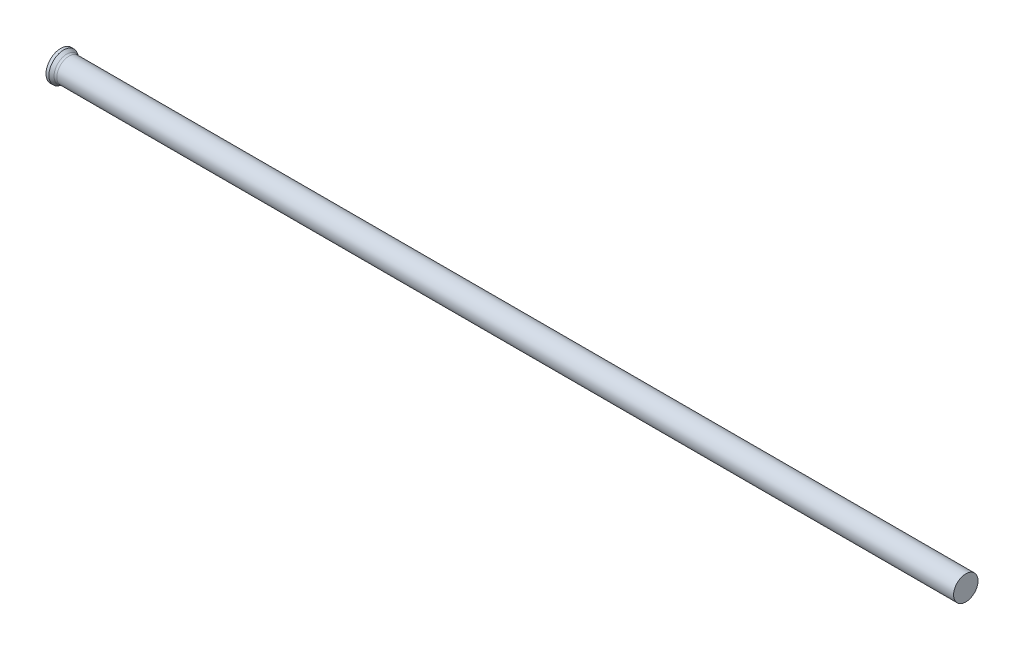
ISO-10303-21;
HEADER;
FILE_DESCRIPTION(('STEP AP214'),'2;1');
FILE_NAME('part.step','',(''),(''),'','','');
FILE_SCHEMA(('AUTOMOTIVE_DESIGN { 1 0 10303 214 1 1 1 1 }'));
ENDSEC;
DATA;
#1=APPLICATION_CONTEXT('core data for automotive mechanical design processes');
#2=APPLICATION_PROTOCOL_DEFINITION('international standard','automotive_design',2000,#1);
#3=PRODUCT_CONTEXT('',#1,'mechanical');
#4=PRODUCT('Part','Part','',(#3));
#5=PRODUCT_RELATED_PRODUCT_CATEGORY('part','',(#4));
#6=PRODUCT_DEFINITION_FORMATION('','',#4);
#7=PRODUCT_DEFINITION_CONTEXT('part definition',#1,'design');
#8=PRODUCT_DEFINITION('design','',#6,#7);
#9=PRODUCT_DEFINITION_SHAPE('','',#8);
#10=(LENGTH_UNIT() NAMED_UNIT(*) SI_UNIT(.MILLI.,.METRE.));
#11=(NAMED_UNIT(*) PLANE_ANGLE_UNIT() SI_UNIT($,.RADIAN.));
#12=(NAMED_UNIT(*) SI_UNIT($,.STERADIAN.) SOLID_ANGLE_UNIT());
#13=UNCERTAINTY_MEASURE_WITH_UNIT(LENGTH_MEASURE(1.E-05),#10,'distance_accuracy_value','');
#14=(GEOMETRIC_REPRESENTATION_CONTEXT(3) GLOBAL_UNCERTAINTY_ASSIGNED_CONTEXT((#13)) GLOBAL_UNIT_ASSIGNED_CONTEXT((#10,
#11,#12)) REPRESENTATION_CONTEXT('',''));
#15=CARTESIAN_POINT('',(0.,0.,0.));
#16=DIRECTION('',(0.,0.,1.));
#17=DIRECTION('',(1.,0.,0.));
#18=AXIS2_PLACEMENT_3D('',#15,#16,#17);
#19=CARTESIAN_POINT('',(0.,0.,0.));
#20=DIRECTION('',(1.,0.,0.));
#21=DIRECTION('',(0.,0.,-1.));
#22=AXIS2_PLACEMENT_3D('',#19,#20,#21);
#23=PLANE('',#22);
#24=CARTESIAN_POINT('',(0.,0.,0.));
#25=DIRECTION('',(-1.,0.,0.));
#26=DIRECTION('',(0.,0.,1.));
#27=AXIS2_PLACEMENT_3D('',#24,#25,#26);
#28=CIRCLE('',#27,3.25);
#29=CARTESIAN_POINT('',(0.,0.,3.25));
#30=VERTEX_POINT('',#29);
#31=EDGE_CURVE('E25',#30,#30,#28,.T.);
#32=ORIENTED_EDGE('',*,*,#31,.T.);
#33=EDGE_LOOP('',(#32));
#34=FACE_BOUND('',#33,.T.);
#35=ADVANCED_FACE('F14',(#34),#23,.F.);
#36=CARTESIAN_POINT('',(0.,0.,0.));
#37=DIRECTION('',(-1.,0.,0.));
#38=DIRECTION('',(0.,0.,1.));
#39=AXIS2_PLACEMENT_3D('',#36,#37,#38);
#40=CYLINDRICAL_SURFACE('',#39,3.25);
#41=ORIENTED_EDGE('',*,*,#31,.F.);
#42=EDGE_LOOP('',(#41));
#43=FACE_BOUND('',#42,.T.);
#44=CARTESIAN_POINT('',(0.637372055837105,0.,0.));
#45=DIRECTION('',(-1.,0.,0.));
#46=DIRECTION('',(0.,0.,1.));
#47=AXIS2_PLACEMENT_3D('',#44,#45,#46);
#48=CIRCLE('',#47,3.25);
#49=CARTESIAN_POINT('',(0.637372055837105,0.,3.25));
#50=VERTEX_POINT('',#49);
#51=EDGE_CURVE('E29',#50,#50,#48,.T.);
#52=ORIENTED_EDGE('',*,*,#51,.T.);
#53=EDGE_LOOP('',(#52));
#54=FACE_BOUND('',#53,.T.);
#55=ADVANCED_FACE('F53',(#43,#54),#40,.T.);
#56=CARTESIAN_POINT('',(1.59,0.,0.));
#57=DIRECTION('',(-1.,0.,0.));
#58=DIRECTION('',(0.,0.,1.));
#59=AXIS2_PLACEMENT_3D('',#56,#57,#58);
#60=CONICAL_SURFACE('',#59,2.7,0.523598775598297);
#61=CARTESIAN_POINT('',(1.35794919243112,0.,0.));
#62=DIRECTION('',(-1.,0.,0.));
#63=DIRECTION('',(0.,0.,1.));
#64=AXIS2_PLACEMENT_3D('',#61,#62,#63);
#65=CIRCLE('',#64,2.83397459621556);
#66=CARTESIAN_POINT('',(1.35794919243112,0.,2.83397459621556));
#67=VERTEX_POINT('',#66);
#68=EDGE_CURVE('E21',#67,#67,#65,.T.);
#69=ORIENTED_EDGE('',*,*,#68,.T.);
#70=EDGE_LOOP('',(#69));
#71=FACE_BOUND('',#70,.T.);
#72=ORIENTED_EDGE('',*,*,#51,.F.);
#73=EDGE_LOOP('',(#72));
#74=FACE_BOUND('',#73,.T.);
#75=ADVANCED_FACE('F50',(#71,#74),#60,.T.);
#76=CARTESIAN_POINT('',(0.,0.,0.));
#77=DIRECTION('',(-1.,0.,0.));
#78=DIRECTION('',(0.,0.,1.));
#79=AXIS2_PLACEMENT_3D('',#76,#77,#78);
#80=CYLINDRICAL_SURFACE('',#79,2.7);
#81=CARTESIAN_POINT('',(1.85794919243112,0.,0.));
#82=DIRECTION('',(-1.,0.,0.));
#83=DIRECTION('',(0.,0.,1.));
#84=AXIS2_PLACEMENT_3D('',#81,#82,#83);
#85=CIRCLE('',#84,2.7);
#86=CARTESIAN_POINT('',(1.85794919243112,0.,2.7));
#87=VERTEX_POINT('',#86);
#88=EDGE_CURVE('E9',#87,#87,#85,.F.);
#89=ORIENTED_EDGE('',*,*,#88,.T.);
#90=EDGE_LOOP('',(#89));
#91=FACE_BOUND('',#90,.T.);
#92=CARTESIAN_POINT('',(200.,0.,0.));
#93=DIRECTION('',(-1.,0.,0.));
#94=DIRECTION('',(0.,0.,1.));
#95=AXIS2_PLACEMENT_3D('',#92,#93,#94);
#96=CIRCLE('',#95,2.7);
#97=CARTESIAN_POINT('',(200.,0.,2.7));
#98=VERTEX_POINT('',#97);
#99=EDGE_CURVE('E34',#98,#98,#96,.T.);
#100=ORIENTED_EDGE('',*,*,#99,.T.);
#101=EDGE_LOOP('',(#100));
#102=FACE_BOUND('',#101,.T.);
#103=ADVANCED_FACE('F38',(#91,#102),#80,.T.);
#104=CARTESIAN_POINT('',(200.,2.7,0.));
#105=DIRECTION('',(-1.,0.,0.));
#106=DIRECTION('',(0.,0.,1.));
#107=AXIS2_PLACEMENT_3D('',#104,#105,#106);
#108=PLANE('',#107);
#109=ORIENTED_EDGE('',*,*,#99,.F.);
#110=EDGE_LOOP('',(#109));
#111=FACE_BOUND('',#110,.T.);
#112=ADVANCED_FACE('F40',(#111),#108,.F.);
#113=CARTESIAN_POINT('',(1.85794919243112,0.,0.));
#114=DIRECTION('',(-1.,0.,0.));
#115=DIRECTION('',(0.,0.,1.));
#116=AXIS2_PLACEMENT_3D('',#113,#114,#115);
#117=TOROIDAL_SURFACE('',#116,3.7,1.);
#118=ORIENTED_EDGE('',*,*,#88,.F.);
#119=EDGE_LOOP('',(#118));
#120=FACE_BOUND('',#119,.T.);
#121=ORIENTED_EDGE('',*,*,#68,.F.);
#122=EDGE_LOOP('',(#121));
#123=FACE_BOUND('',#122,.T.);
#124=ADVANCED_FACE('F16',(#120,#123),#117,.F.);
#125=CLOSED_SHELL('',(#35,#55,#75,#103,#112,#124));
#126=MANIFOLD_SOLID_BREP('B1',#125);
#127=ADVANCED_BREP_SHAPE_REPRESENTATION('',(#18,#126),#14);
#128=SHAPE_DEFINITION_REPRESENTATION(#9,#127);
ENDSEC;
END-ISO-10303-21;
